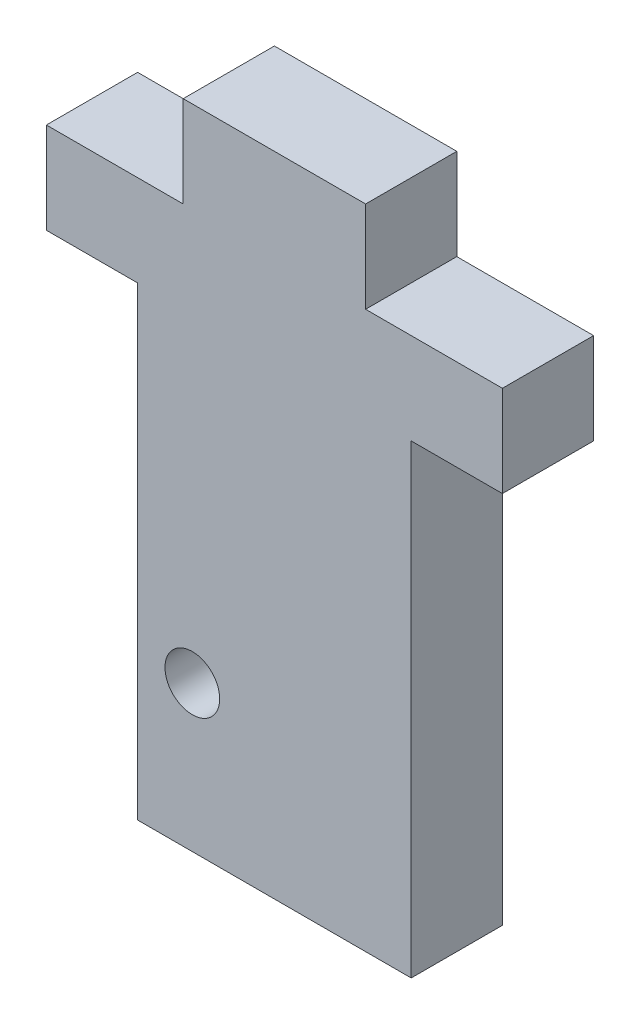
from build123d import *

# Parameters (mm, degrees)
ESQUISSE1_W             = 25
ESQUISSE1_H             = 35.5
BOSS_EXTRU_1_DEPTH      = 5
ENL_V_MAT_EXTRU_1_REACH = 24.278
ESQUISSE2_W             = 7.5
ESQUISSE2_H             = 5
ENL_V_MAT_EXTRU_2_REACH = 24.278
ESQUISSE3_W             = 5
ESQUISSE3_H             = 25.5
ENL_V_MAT_EXTRU_3_REACH = 24.278
ESQUISSE4_R             = 1.5


with BuildPart() as part:
    # Esquisse1 → Boss.-Extru.1 (new body)
    with BuildSketch(Plane.XY):
        Rectangle(ESQUISSE1_W, ESQUISSE1_H)
    extrude(amount=BOSS_EXTRU_1_DEPTH)

    # Esquisse2 → Enl_v. mat.-Extru.1 (cut, up to next)
    with BuildSketch(Plane.XY.offset(5), mode=Mode.PRIVATE) as enl_v_mat_extru_1_sk1:
        with Locations((-8.75, 15.25)):
            Rectangle(ESQUISSE2_W, ESQUISSE2_H)
    enl_v_mat_extru_1_tool1 = extrude(enl_v_mat_extru_1_sk1.sketch, amount=-ENL_V_MAT_EXTRU_1_REACH, mode=Mode.PRIVATE) & part.part
    # Esquisse2 → Enl_v. mat.-Extru.1 (cut, up to next)
    with BuildSketch(Plane.XY.offset(5), mode=Mode.PRIVATE) as enl_v_mat_extru_1_sk2:
        with Locations((8.75, 15.25)):
            Rectangle(ESQUISSE2_W, ESQUISSE2_H)
    enl_v_mat_extru_1_tool2 = extrude(enl_v_mat_extru_1_sk2.sketch, amount=-ENL_V_MAT_EXTRU_1_REACH, mode=Mode.PRIVATE) & part.part
    add(enl_v_mat_extru_1_tool1.solids().sort_by_distance((-8.75, 15.25, 5))[0], mode=Mode.SUBTRACT)
    add(enl_v_mat_extru_1_tool2.solids().sort_by_distance((8.75, 15.25, 5))[0], mode=Mode.SUBTRACT)

    # Esquisse3 → Enl_v. mat.-Extru.2 (cut, up to next)
    with BuildSketch(Plane.XY.offset(5), mode=Mode.PRIVATE) as enl_v_mat_extru_2_sk1:
        with Locations((-10, -5)):
            Rectangle(ESQUISSE3_W, ESQUISSE3_H)
    enl_v_mat_extru_2_tool1 = extrude(enl_v_mat_extru_2_sk1.sketch, amount=-ENL_V_MAT_EXTRU_2_REACH, mode=Mode.PRIVATE) & part.part
    # Esquisse3 → Enl_v. mat.-Extru.2 (cut, up to next)
    with BuildSketch(Plane.XY.offset(5), mode=Mode.PRIVATE) as enl_v_mat_extru_2_sk2:
        with Locations((10, -5)):
            Rectangle(ESQUISSE3_W, ESQUISSE3_H)
    enl_v_mat_extru_2_tool2 = extrude(enl_v_mat_extru_2_sk2.sketch, amount=-ENL_V_MAT_EXTRU_2_REACH, mode=Mode.PRIVATE) & part.part
    add(enl_v_mat_extru_2_tool1.solids().sort_by_distance((-10, -5, 5))[0], mode=Mode.SUBTRACT)
    add(enl_v_mat_extru_2_tool2.solids().sort_by_distance((10, -5, 5))[0], mode=Mode.SUBTRACT)

    # Esquisse4 → Enl_v. mat.-Extru.3 (cut, up to next)
    with BuildSketch(Plane.XY.offset(5), mode=Mode.PRIVATE) as enl_v_mat_extru_3_sk1:
        with Locations((-4.5, -9.75)):
            Circle(ESQUISSE4_R)
    enl_v_mat_extru_3_tool1 = extrude(enl_v_mat_extru_3_sk1.sketch, amount=-ENL_V_MAT_EXTRU_3_REACH, mode=Mode.PRIVATE) & part.part
    add(enl_v_mat_extru_3_tool1.solids().sort_by_distance((-4.5, -9.75, 5))[0], mode=Mode.SUBTRACT)


solid = part.part
